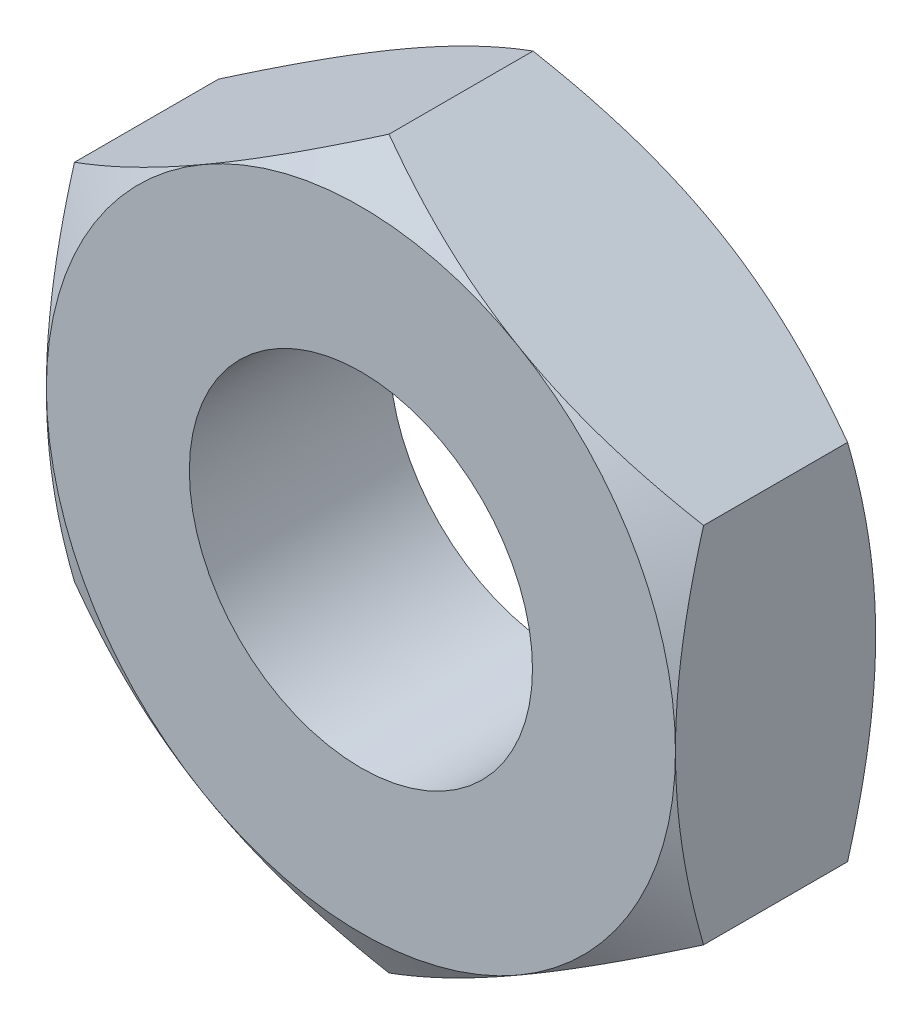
ISO-10303-21;
HEADER;
FILE_DESCRIPTION(('STEP AP214'),'2;1');
FILE_NAME('part.step','',(''),(''),'','','');
FILE_SCHEMA(('AUTOMOTIVE_DESIGN { 1 0 10303 214 1 1 1 1 }'));
ENDSEC;
DATA;
#1=APPLICATION_CONTEXT('core data for automotive mechanical design processes');
#2=APPLICATION_PROTOCOL_DEFINITION('international standard','automotive_design',2000,#1);
#3=PRODUCT_CONTEXT('',#1,'mechanical');
#4=PRODUCT('Part','Part','',(#3));
#5=PRODUCT_RELATED_PRODUCT_CATEGORY('part','',(#4));
#6=PRODUCT_DEFINITION_FORMATION('','',#4);
#7=PRODUCT_DEFINITION_CONTEXT('part definition',#1,'design');
#8=PRODUCT_DEFINITION('design','',#6,#7);
#9=PRODUCT_DEFINITION_SHAPE('','',#8);
#10=(LENGTH_UNIT() NAMED_UNIT(*) SI_UNIT(.MILLI.,.METRE.));
#11=(NAMED_UNIT(*) PLANE_ANGLE_UNIT() SI_UNIT($,.RADIAN.));
#12=(NAMED_UNIT(*) SI_UNIT($,.STERADIAN.) SOLID_ANGLE_UNIT());
#13=UNCERTAINTY_MEASURE_WITH_UNIT(LENGTH_MEASURE(1.E-05),#10,'distance_accuracy_value','');
#14=(GEOMETRIC_REPRESENTATION_CONTEXT(3) GLOBAL_UNCERTAINTY_ASSIGNED_CONTEXT((#13)) GLOBAL_UNIT_ASSIGNED_CONTEXT((#10,
#11,#12)) REPRESENTATION_CONTEXT('',''));
#15=CARTESIAN_POINT('',(0.,0.,0.));
#16=DIRECTION('',(0.,0.,1.));
#17=DIRECTION('',(1.,0.,0.));
#18=AXIS2_PLACEMENT_3D('',#15,#16,#17);
#19=CARTESIAN_POINT('',(11.,6.35085296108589,7.));
#20=DIRECTION('',(-0.5,-0.866025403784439,0.));
#21=DIRECTION('',(0.866025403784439,-0.5,0.));
#22=AXIS2_PLACEMENT_3D('',#19,#20,#21);
#23=PLANE('',#22);
#24=CARTESIAN_POINT('',(-0.000200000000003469,12.7018213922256,0.982547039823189));
#25=CARTESIAN_POINT('',(0.241603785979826,12.5622159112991,0.901959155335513));
#26=CARTESIAN_POINT('',(0.484309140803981,12.4220899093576,0.825028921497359));
#27=CARTESIAN_POINT('',(0.971666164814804,12.1407142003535,0.679498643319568));
#28=CARTESIAN_POINT('',(1.21631844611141,11.999464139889,0.610901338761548));
#29=CARTESIAN_POINT('',(1.9542173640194,11.5734380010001,0.418936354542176));
#30=CARTESIAN_POINT('',(2.45037695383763,11.2869801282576,0.309747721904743));
#31=CARTESIAN_POINT('',(3.19285703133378,10.8583090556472,0.181714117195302));
#32=CARTESIAN_POINT('',(3.43695934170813,10.7173765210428,0.145242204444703));
#33=CARTESIAN_POINT('',(3.92629418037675,10.4348589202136,0.084081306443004));
#34=CARTESIAN_POINT('',(4.17152673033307,10.2932738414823,0.0593925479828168));
#35=CARTESIAN_POINT('',(4.66240068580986,10.0098676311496,0.0224303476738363));
#36=CARTESIAN_POINT('',(4.90804125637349,9.86804698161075,0.0101421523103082));
#37=CARTESIAN_POINT('',(5.39955001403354,9.58427426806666,-0.00175707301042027));
#38=CARTESIAN_POINT('',(5.64541819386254,9.44232220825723,-0.00136849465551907));
#39=CARTESIAN_POINT('',(6.10507018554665,9.17694200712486,0.0112011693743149));
#40=CARTESIAN_POINT('',(6.31888677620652,9.05349494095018,0.0218490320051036));
#41=CARTESIAN_POINT('',(6.74602818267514,8.80688473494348,0.0525316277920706));
#42=CARTESIAN_POINT('',(6.95935296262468,8.68372161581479,0.0725670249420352));
#43=CARTESIAN_POINT('',(7.3853948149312,8.43774623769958,0.121675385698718));
#44=CARTESIAN_POINT('',(7.5981112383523,8.31493435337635,0.150755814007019));
#45=CARTESIAN_POINT('',(8.02254681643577,8.06988635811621,0.217443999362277));
#46=CARTESIAN_POINT('',(8.23426590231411,7.94765028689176,0.255052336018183));
#47=CARTESIAN_POINT('',(8.87695113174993,7.5765957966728,0.381619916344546));
#48=CARTESIAN_POINT('',(9.30605612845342,7.32885191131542,0.483199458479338));
#49=CARTESIAN_POINT('',(10.1578675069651,6.83705838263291,0.713743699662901));
#50=CARTESIAN_POINT('',(10.580584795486,6.59300244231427,0.842654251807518));
#51=CARTESIAN_POINT('',(11.0002,6.35073749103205,0.982547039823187));
#52=B_SPLINE_CURVE_WITH_KNOTS('',3,(#24,#25,#26,#27,#28,#29,#30,#31,#32,#33,#34,#35,#36,#37,#38,
#39,#40,#41,#42,#43,#44,#45,#46,#47,#48,#49,#50,#51),.UNSPECIFIED.,.F.,.F.,(4,2,2,2,2,2,2,2,2,2,
2,2,2,4),(0.,0.871755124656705,1.74379610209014,3.49159027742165,4.34403665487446,
5.19649943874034,6.04794680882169,6.89936787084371,7.64056020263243,8.38180496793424,
9.1236630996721,9.86557166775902,11.3820155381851,12.8954827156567),.UNSPECIFIED.);
#53=CARTESIAN_POINT('',(0.,12.7017059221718,0.982480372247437));
#54=VERTEX_POINT('',#53);
#55=CARTESIAN_POINT('',(5.5,9.52627944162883,0.));
#56=VERTEX_POINT('',#55);
#57=EDGE_CURVE('E29',#54,#56,#52,.T.);
#58=ORIENTED_EDGE('',*,*,#57,.F.);
#59=DIRECTION('',(0.,0.,-1.));
#60=VECTOR('',#59,1.);
#61=CARTESIAN_POINT('',(0.,12.7017059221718,7.));
#62=LINE('',#61,#60);
#63=CARTESIAN_POINT('',(0.,12.7017059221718,6.01751962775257));
#64=VERTEX_POINT('',#63);
#65=EDGE_CURVE('E146',#64,#54,#62,.T.);
#66=ORIENTED_EDGE('',*,*,#65,.F.);
#67=CARTESIAN_POINT('',(11.0002,6.35073749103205,6.01745296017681));
#68=CARTESIAN_POINT('',(10.7583962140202,6.49034297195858,6.09804084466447));
#69=CARTESIAN_POINT('',(10.515690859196,6.63046897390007,6.17497107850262));
#70=CARTESIAN_POINT('',(10.0283338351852,6.91184468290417,6.32050135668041));
#71=CARTESIAN_POINT('',(9.78368155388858,7.05309474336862,6.38909866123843));
#72=CARTESIAN_POINT('',(9.0457826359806,7.47912088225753,6.5810636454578));
#73=CARTESIAN_POINT('',(8.54962304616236,7.76557875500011,6.69025227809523));
#74=CARTESIAN_POINT('',(7.80714296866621,8.19424982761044,6.81828588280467));
#75=CARTESIAN_POINT('',(7.56304065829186,8.33518236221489,6.85475779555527));
#76=CARTESIAN_POINT('',(7.07370581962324,8.61769996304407,6.91591869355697));
#77=CARTESIAN_POINT('',(6.82847326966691,8.75928504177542,6.94060745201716));
#78=CARTESIAN_POINT('',(6.33759931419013,9.04269125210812,6.97756965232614));
#79=CARTESIAN_POINT('',(6.0919587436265,9.18451190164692,6.98985784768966));
#80=CARTESIAN_POINT('',(5.60044998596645,9.46828461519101,7.0017570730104));
#81=CARTESIAN_POINT('',(5.35458180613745,9.61023667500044,7.00136849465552));
#82=CARTESIAN_POINT('',(4.89492981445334,9.87561687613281,6.98879883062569));
#83=CARTESIAN_POINT('',(4.68111322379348,9.99906394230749,6.97815096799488));
#84=CARTESIAN_POINT('',(4.25397181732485,10.2456741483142,6.9474683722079));
#85=CARTESIAN_POINT('',(4.04064703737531,10.3688372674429,6.92743297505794));
#86=CARTESIAN_POINT('',(3.6146051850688,10.6148126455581,6.87832461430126));
#87=CARTESIAN_POINT('',(3.4018887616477,10.7376245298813,6.84924418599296));
#88=CARTESIAN_POINT('',(2.97745318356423,10.9826725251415,6.7825560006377));
#89=CARTESIAN_POINT('',(2.76573409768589,11.1049085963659,6.74494766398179));
#90=CARTESIAN_POINT('',(2.12304886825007,11.4759630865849,6.61838008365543));
#91=CARTESIAN_POINT('',(1.69394387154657,11.7237069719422,6.51680054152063));
#92=CARTESIAN_POINT('',(0.84213249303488,12.2155005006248,6.28625630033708));
#93=CARTESIAN_POINT('',(0.419415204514,12.4595564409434,6.15734574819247));
#94=CARTESIAN_POINT('',(-0.000200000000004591,12.7018213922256,6.01745296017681));
#95=B_SPLINE_CURVE_WITH_KNOTS('',3,(#67,#68,#69,#70,#71,#72,#73,#74,#75,#76,#77,#78,#79,#80,#81,
#82,#83,#84,#85,#86,#87,#88,#89,#90,#91,#92,#93,#94),.UNSPECIFIED.,.F.,.F.,(4,2,2,2,2,2,2,2,2,2,
2,2,2,4),(0.,0.871755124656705,1.74379610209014,3.49159027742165,4.34403665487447,
5.19649943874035,6.0479468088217,6.89936787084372,7.64056020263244,8.38180496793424,
9.1236630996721,9.86557166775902,11.3820155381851,12.8954827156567),.UNSPECIFIED.);
#96=CARTESIAN_POINT('',(5.5,9.52627944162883,7.));
#97=VERTEX_POINT('',#96);
#98=EDGE_CURVE('E205',#97,#64,#95,.T.);
#99=ORIENTED_EDGE('',*,*,#98,.F.);
#100=CARTESIAN_POINT('',(11.,6.35085296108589,6.01751962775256));
#101=VERTEX_POINT('',#100);
#102=EDGE_CURVE('E313',#101,#97,#95,.T.);
#103=ORIENTED_EDGE('',*,*,#102,.F.);
#104=DIRECTION('',(0.,0.,-1.));
#105=VECTOR('',#104,1.);
#106=CARTESIAN_POINT('',(11.,6.35085296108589,7.));
#107=LINE('',#106,#105);
#108=CARTESIAN_POINT('',(11.,6.35085296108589,0.982480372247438));
#109=VERTEX_POINT('',#108);
#110=EDGE_CURVE('E132',#101,#109,#107,.T.);
#111=ORIENTED_EDGE('',*,*,#110,.T.);
#112=EDGE_CURVE('E125',#56,#109,#52,.T.);
#113=ORIENTED_EDGE('',*,*,#112,.F.);
#114=EDGE_LOOP('',(#58,#66,#99,#103,#111,#113));
#115=FACE_BOUND('',#114,.T.);
#116=ADVANCED_FACE('F14',(#115),#23,.F.);
#117=CARTESIAN_POINT('',(0.,12.7017059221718,7.));
#118=DIRECTION('',(0.5,-0.866025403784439,0.));
#119=DIRECTION('',(0.866025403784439,0.5,0.));
#120=AXIS2_PLACEMENT_3D('',#117,#118,#119);
#121=PLANE('',#120);
#122=CARTESIAN_POINT('',(-11.0002,6.35073749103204,0.982547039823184));
#123=CARTESIAN_POINT('',(-10.7583962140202,6.49034297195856,0.901959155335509));
#124=CARTESIAN_POINT('',(-10.515690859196,6.63046897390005,0.825028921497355));
#125=CARTESIAN_POINT('',(-10.0283338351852,6.91184468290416,0.679498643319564));
#126=CARTESIAN_POINT('',(-9.78368155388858,7.05309474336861,0.610901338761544));
#127=CARTESIAN_POINT('',(-9.0457826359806,7.47912088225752,0.41893635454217));
#128=CARTESIAN_POINT('',(-8.54962304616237,7.76557875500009,0.309747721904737));
#129=CARTESIAN_POINT('',(-7.80714296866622,8.19424982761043,0.181714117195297));
#130=CARTESIAN_POINT('',(-7.56304065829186,8.33518236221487,0.145242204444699));
#131=CARTESIAN_POINT('',(-7.07370581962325,8.61769996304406,0.0840813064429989));
#132=CARTESIAN_POINT('',(-6.82847326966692,8.7592850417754,0.0593925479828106));
#133=CARTESIAN_POINT('',(-6.33759931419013,9.0426912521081,0.0224303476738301));
#134=CARTESIAN_POINT('',(-6.0919587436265,9.1845119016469,0.0101421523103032));
#135=CARTESIAN_POINT('',(-5.60044998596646,9.46828461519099,-0.00175707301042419));
#136=CARTESIAN_POINT('',(-5.35458180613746,9.61023667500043,-0.0013684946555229));
#137=CARTESIAN_POINT('',(-4.89492981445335,9.87561687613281,0.0112011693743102));
#138=CARTESIAN_POINT('',(-4.68111322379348,9.99906394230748,0.021849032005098));
#139=CARTESIAN_POINT('',(-4.25397181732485,10.2456741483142,0.0525316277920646));
#140=CARTESIAN_POINT('',(-4.04064703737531,10.3688372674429,0.0725670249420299));
#141=CARTESIAN_POINT('',(-3.6146051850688,10.6148126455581,0.121675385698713));
#142=CARTESIAN_POINT('',(-3.4018887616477,10.7376245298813,0.150755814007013));
#143=CARTESIAN_POINT('',(-2.97745318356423,10.9826725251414,0.217443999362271));
#144=CARTESIAN_POINT('',(-2.76573409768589,11.1049085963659,0.255052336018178));
#145=CARTESIAN_POINT('',(-2.12304886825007,11.4759630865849,0.381619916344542));
#146=CARTESIAN_POINT('',(-1.69394387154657,11.7237069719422,0.483199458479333));
#147=CARTESIAN_POINT('',(-0.84213249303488,12.2155005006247,0.713743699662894));
#148=CARTESIAN_POINT('',(-0.419415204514,12.4595564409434,0.842654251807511));
#149=CARTESIAN_POINT('',(0.000199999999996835,12.7018213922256,0.982547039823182));
#150=B_SPLINE_CURVE_WITH_KNOTS('',3,(#122,#123,#124,#125,#126,#127,#128,#129,#130,#131,#132,
#133,#134,#135,#136,#137,#138,#139,#140,#141,#142,#143,#144,#145,#146,#147,#148,#149),
.UNSPECIFIED.,.F.,.F.,(4,2,2,2,2,2,2,2,2,2,2,2,2,4),(0.,0.871755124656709,1.74379610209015,
3.49159027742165,4.34403665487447,5.19649943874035,6.04794680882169,6.89936787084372,
7.64056020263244,8.38180496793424,9.1236630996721,9.86557166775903,11.3820155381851,
12.8954827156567),.UNSPECIFIED.);
#151=CARTESIAN_POINT('',(-11.,6.35085296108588,0.982480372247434));
#152=VERTEX_POINT('',#151);
#153=CARTESIAN_POINT('',(-5.5,9.52627944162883,0.));
#154=VERTEX_POINT('',#153);
#155=EDGE_CURVE('E37',#152,#154,#150,.T.);
#156=ORIENTED_EDGE('',*,*,#155,.F.);
#157=DIRECTION('',(0.,0.,-1.));
#158=VECTOR('',#157,1.);
#159=CARTESIAN_POINT('',(-11.,6.35085296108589,7.));
#160=LINE('',#159,#158);
#161=CARTESIAN_POINT('',(-11.,6.35085296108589,6.01751962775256));
#162=VERTEX_POINT('',#161);
#163=EDGE_CURVE('E143',#162,#152,#160,.T.);
#164=ORIENTED_EDGE('',*,*,#163,.F.);
#165=CARTESIAN_POINT('',(0.000199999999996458,12.7018213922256,6.01745296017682));
#166=CARTESIAN_POINT('',(-0.241603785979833,12.5622159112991,6.09804084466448));
#167=CARTESIAN_POINT('',(-0.484309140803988,12.4220899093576,6.17497107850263));
#168=CARTESIAN_POINT('',(-0.971666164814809,12.1407142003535,6.32050135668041));
#169=CARTESIAN_POINT('',(-1.21631844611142,11.999464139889,6.38909866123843));
#170=CARTESIAN_POINT('',(-1.9542173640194,11.5734380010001,6.58106364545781));
#171=CARTESIAN_POINT('',(-2.45037695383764,11.2869801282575,6.69025227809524));
#172=CARTESIAN_POINT('',(-3.19285703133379,10.8583090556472,6.81828588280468));
#173=CARTESIAN_POINT('',(-3.43695934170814,10.7173765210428,6.85475779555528));
#174=CARTESIAN_POINT('',(-3.92629418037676,10.4348589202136,6.91591869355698));
#175=CARTESIAN_POINT('',(-4.17152673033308,10.2932738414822,6.94060745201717));
#176=CARTESIAN_POINT('',(-4.66240068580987,10.0098676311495,6.97756965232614));
#177=CARTESIAN_POINT('',(-4.9080412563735,9.86804698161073,6.98985784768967));
#178=CARTESIAN_POINT('',(-5.39955001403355,9.58427426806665,7.00175707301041));
#179=CARTESIAN_POINT('',(-5.64541819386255,9.44232220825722,7.00136849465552));
#180=CARTESIAN_POINT('',(-6.10507018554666,9.17694200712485,6.98879883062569));
#181=CARTESIAN_POINT('',(-6.31888677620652,9.05349494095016,6.97815096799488));
#182=CARTESIAN_POINT('',(-6.74602818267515,8.80688473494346,6.9474683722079));
#183=CARTESIAN_POINT('',(-6.95935296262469,8.68372161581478,6.92743297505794));
#184=CARTESIAN_POINT('',(-7.3853948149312,8.43774623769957,6.87832461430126));
#185=CARTESIAN_POINT('',(-7.5981112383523,8.31493435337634,6.84924418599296));
#186=CARTESIAN_POINT('',(-8.02254681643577,8.06988635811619,6.7825560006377));
#187=CARTESIAN_POINT('',(-8.23426590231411,7.94765028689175,6.7449476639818));
#188=CARTESIAN_POINT('',(-8.87695113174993,7.57659579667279,6.61838008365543));
#189=CARTESIAN_POINT('',(-9.30605612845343,7.32885191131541,6.51680054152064));
#190=CARTESIAN_POINT('',(-10.1578675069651,6.8370583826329,6.28625630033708));
#191=CARTESIAN_POINT('',(-10.580584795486,6.59300244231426,6.15734574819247));
#192=CARTESIAN_POINT('',(-11.0002,6.35073749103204,6.01745296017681));
#193=B_SPLINE_CURVE_WITH_KNOTS('',3,(#165,#166,#167,#168,#169,#170,#171,#172,#173,#174,#175,
#176,#177,#178,#179,#180,#181,#182,#183,#184,#185,#186,#187,#188,#189,#190,#191,#192),
.UNSPECIFIED.,.F.,.F.,(4,2,2,2,2,2,2,2,2,2,2,2,2,4),(0.,0.871755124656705,1.74379610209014,
3.49159027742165,4.34403665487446,5.19649943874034,6.04794680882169,6.89936787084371,
7.64056020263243,8.38180496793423,9.12366309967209,9.86557166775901,11.3820155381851,
12.8954827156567),.UNSPECIFIED.);
#194=CARTESIAN_POINT('',(-5.5,9.52627944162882,7.));
#195=VERTEX_POINT('',#194);
#196=EDGE_CURVE('E198',#195,#162,#193,.T.);
#197=ORIENTED_EDGE('',*,*,#196,.F.);
#198=EDGE_CURVE('E203',#64,#195,#193,.T.);
#199=ORIENTED_EDGE('',*,*,#198,.F.);
#200=ORIENTED_EDGE('',*,*,#65,.T.);
#201=EDGE_CURVE('E219',#154,#54,#150,.T.);
#202=ORIENTED_EDGE('',*,*,#201,.F.);
#203=EDGE_LOOP('',(#156,#164,#197,#199,#200,#202));
#204=FACE_BOUND('',#203,.T.);
#205=ADVANCED_FACE('F211',(#204),#121,.F.);
#206=CARTESIAN_POINT('',(-11.,6.35085296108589,7.));
#207=DIRECTION('',(1.,0.,0.));
#208=DIRECTION('',(0.,1.,0.));
#209=AXIS2_PLACEMENT_3D('',#206,#207,#208);
#210=PLANE('',#209);
#211=CARTESIAN_POINT('',(-11.,-16.9840885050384,5.3318873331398));
#212=CARTESIAN_POINT('',(-11.,-16.7441917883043,5.2156376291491));
#213=CARTESIAN_POINT('',(-11.,-16.5040115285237,5.09997333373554));
#214=CARTESIAN_POINT('',(-11.,-16.0230247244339,4.86994829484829));
#215=CARTESIAN_POINT('',(-11.,-15.7822181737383,4.75558756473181));
#216=CARTESIAN_POINT('',(-11.,-15.0587051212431,4.41462919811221));
#217=CARTESIAN_POINT('',(-11.,-14.5749773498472,4.19019043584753));
#218=CARTESIAN_POINT('',(-11.,-13.6015907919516,3.74721690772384));
#219=CARTESIAN_POINT('',(-11.,-13.1119140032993,3.52872160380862));
#220=CARTESIAN_POINT('',(-11.,-12.128639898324,3.10076972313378));
#221=CARTESIAN_POINT('',(-11.,-11.6350427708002,2.89131271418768));
#222=CARTESIAN_POINT('',(-11.,-10.6274881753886,2.47740062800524));
#223=CARTESIAN_POINT('',(-11.,-10.1133795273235,2.27331162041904));
#224=CARTESIAN_POINT('',(-11.,-9.07911609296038,1.88076176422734));
#225=CARTESIAN_POINT('',(-11.,-8.55896063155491,1.69230268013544));
#226=CARTESIAN_POINT('',(-11.,-7.5127914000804,1.33601802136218));
#227=CARTESIAN_POINT('',(-11.,-6.98679219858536,1.1681500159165));
#228=CARTESIAN_POINT('',(-11.,-5.92719900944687,0.858474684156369));
#229=CARTESIAN_POINT('',(-11.,-5.39360749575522,0.716659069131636));
#230=CARTESIAN_POINT('',(-11.,-4.58891434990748,0.529030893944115));
#231=CARTESIAN_POINT('',(-11.,-4.32069161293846,0.470793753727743));
#232=CARTESIAN_POINT('',(-11.,-3.78242763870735,0.363385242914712));
#233=CARTESIAN_POINT('',(-11.,-3.51238643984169,0.314213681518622));
#234=CARTESIAN_POINT('',(-11.,-2.97067673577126,0.225808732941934));
#235=CARTESIAN_POINT('',(-11.,-2.69900824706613,0.186575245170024));
#236=CARTESIAN_POINT('',(-11.,-2.15433855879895,0.118831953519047));
#237=CARTESIAN_POINT('',(-11.,-1.88133741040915,0.0903217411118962));
#238=CARTESIAN_POINT('',(-11.,-1.33791470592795,0.0449446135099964));
#239=CARTESIAN_POINT('',(-11.,-1.06750538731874,0.0279320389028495));
#240=CARTESIAN_POINT('',(-11.,-0.526210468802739,0.00535229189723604));
#241=CARTESIAN_POINT('',(-11.,-0.255324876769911,-0.000215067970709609));
#242=CARTESIAN_POINT('',(-11.,0.286439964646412,0.000227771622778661));
#243=CARTESIAN_POINT('',(-11.,0.557319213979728,0.00623804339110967));
#244=CARTESIAN_POINT('',(-11.,1.09858564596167,0.0296908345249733));
#245=CARTESIAN_POINT('',(-11.,1.36897280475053,0.0471338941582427));
#246=CARTESIAN_POINT('',(-11.,2.02110256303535,0.102623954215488));
#247=CARTESIAN_POINT('',(-11.,2.40238084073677,0.146223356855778));
#248=CARTESIAN_POINT('',(-11.,3.16206007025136,0.253762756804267));
#249=CARTESIAN_POINT('',(-11.,3.54046061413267,0.317705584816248));
#250=CARTESIAN_POINT('',(-11.,4.29404048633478,0.463656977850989));
#251=CARTESIAN_POINT('',(-11.,4.66921700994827,0.545679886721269));
#252=CARTESIAN_POINT('',(-11.,5.4157832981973,0.725292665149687));
#253=CARTESIAN_POINT('',(-11.,5.78717312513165,0.822882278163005));
#254=CARTESIAN_POINT('',(-11.,6.53425919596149,1.03354404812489));
#255=CARTESIAN_POINT('',(-11.,6.90987275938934,1.14690740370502));
#256=CARTESIAN_POINT('',(-11.,7.65739903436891,1.38518033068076));
#257=CARTESIAN_POINT('',(-11.,8.02931172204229,1.5100899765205));
#258=CARTESIAN_POINT('',(-11.,8.76962268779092,1.76948687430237));
#259=CARTESIAN_POINT('',(-11.,9.1380221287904,1.90397082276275));
#260=CARTESIAN_POINT('',(-11.,9.87177985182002,2.18095058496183));
#261=CARTESIAN_POINT('',(-11.,10.2371381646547,2.32344631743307));
#262=CARTESIAN_POINT('',(-11.,11.0790169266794,2.66073366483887));
#263=CARTESIAN_POINT('',(-11.,11.5545670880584,2.85794306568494));
#264=CARTESIAN_POINT('',(-11.,12.5017815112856,3.26150850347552));
#265=CARTESIAN_POINT('',(-11.,12.9734455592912,3.46786503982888));
#266=CARTESIAN_POINT('',(-11.,13.9135842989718,3.88794944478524));
#267=CARTESIAN_POINT('',(-11.,14.3820583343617,4.10167877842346));
#268=CARTESIAN_POINT('',(-11.,15.3162376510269,4.53506873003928));
#269=CARTESIAN_POINT('',(-11.,15.7819429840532,4.75472923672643));
#270=CARTESIAN_POINT('',(-11.,16.7114982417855,5.19912871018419));
#271=CARTESIAN_POINT('',(-11.,17.1753458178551,5.42387258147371));
#272=CARTESIAN_POINT('',(-11.,18.1010724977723,5.8773774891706));
#273=CARTESIAN_POINT('',(-11.,18.5629515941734,6.1061385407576));
#274=CARTESIAN_POINT('',(-11.,19.4849820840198,6.56698070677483));
#275=CARTESIAN_POINT('',(-11.,19.945133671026,6.79906143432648));
#276=CARTESIAN_POINT('',(-11.,20.864006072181,7.26603974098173));
#277=CARTESIAN_POINT('',(-11.,21.3227268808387,7.50093733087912));
#278=CARTESIAN_POINT('',(-11.,22.6235178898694,8.17129985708));
#279=CARTESIAN_POINT('',(-11.,23.4641281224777,8.60959780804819));
#280=CARTESIAN_POINT('',(-11.,25.1421953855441,9.49223873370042));
#281=CARTESIAN_POINT('',(-11.,25.9796523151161,9.93658189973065));
#282=CARTESIAN_POINT('',(-11.,27.6501346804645,10.828880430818));
#283=CARTESIAN_POINT('',(-11.,28.4831658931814,11.2768249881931));
#284=CARTESIAN_POINT('',(-11.,29.731214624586,11.9514590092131));
#285=CARTESIAN_POINT('',(-11.,30.1469707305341,12.1767841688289));
#286=CARTESIAN_POINT('',(-11.,30.9780387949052,12.628250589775));
#287=CARTESIAN_POINT('',(-11.,31.3933507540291,12.8543918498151));
#288=CARTESIAN_POINT('',(-11.,31.8084653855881,13.0808948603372));
#289=B_SPLINE_CURVE_WITH_KNOTS('',3,(#211,#212,#213,#214,#215,#216,#217,#218,#219,#220,#221,
#222,#223,#224,#225,#226,#227,#228,#229,#230,#231,#232,#233,#234,#235,#236,#237,#238,#239,#240,
#241,#242,#243,#244,#245,#246,#247,#248,#249,#250,#251,#252,#253,#254,#255,#256,#257,#258,#259,
#260,#261,#262,#263,#264,#265,#266,#267,#268,#269,#270,#271,#272,#273,#274,#275,#276,#277,#278,
#279,#280,#281,#282,#283,#284,#285,#286,#287,#288),.UNSPECIFIED.,.F.,.F.,(4,2,2,2,2,2,2,2,2,2,2,
2,2,2,2,2,2,2,2,2,2,2,2,2,2,2,2,2,2,2,2,2,2,2,2,2,2,2,4),(0.,0.799735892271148,1.59947997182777,
3.19920870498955,4.80777426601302,6.41626282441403,8.07547841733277,9.73488107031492,
11.3908047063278,13.0462005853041,13.8694888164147,14.6927597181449,15.5160222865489,
16.3392534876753,17.1518495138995,17.9644322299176,18.7770200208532,19.5896462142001,
20.7402967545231,21.8911074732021,23.0428344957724,24.1945425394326,25.3713637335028,
26.5481925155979,27.7246171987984,28.9010299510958,30.4453619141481,31.9897782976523,
33.5345033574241,35.0791994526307,36.6254554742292,38.1717173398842,39.7178004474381,
41.2638894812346,44.1078946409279,46.9519900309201,49.7894692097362,51.2081373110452,
52.6268031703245),.UNSPECIFIED.);
#290=CARTESIAN_POINT('',(-11.,-6.35085296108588,0.982480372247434));
#291=VERTEX_POINT('',#290);
#292=CARTESIAN_POINT('',(-11.,0.,0.));
#293=VERTEX_POINT('',#292);
#294=EDGE_CURVE('E237',#291,#293,#289,.T.);
#295=ORIENTED_EDGE('',*,*,#294,.F.);
#296=DIRECTION('',(0.,0.,-1.));
#297=VECTOR('',#296,1.);
#298=CARTESIAN_POINT('',(-11.,-6.35085296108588,7.));
#299=LINE('',#298,#297);
#300=CARTESIAN_POINT('',(-11.,-6.35085296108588,6.01751962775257));
#301=VERTEX_POINT('',#300);
#302=EDGE_CURVE('E134',#301,#291,#299,.T.);
#303=ORIENTED_EDGE('',*,*,#302,.F.);
#304=CARTESIAN_POINT('',(-11.,-16.9840885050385,1.6681126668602));
#305=CARTESIAN_POINT('',(-11.,-16.7441917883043,1.78436237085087));
#306=CARTESIAN_POINT('',(-11.,-16.5040115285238,1.90002666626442));
#307=CARTESIAN_POINT('',(-11.,-16.023024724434,2.13005170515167));
#308=CARTESIAN_POINT('',(-11.,-15.7822181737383,2.24441243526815));
#309=CARTESIAN_POINT('',(-11.,-15.0587051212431,2.58537080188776));
#310=CARTESIAN_POINT('',(-11.,-14.5749773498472,2.80980956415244));
#311=CARTESIAN_POINT('',(-11.,-13.6015907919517,3.25278309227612));
#312=CARTESIAN_POINT('',(-11.,-13.1119140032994,3.47127839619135));
#313=CARTESIAN_POINT('',(-11.,-12.1286398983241,3.89923027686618));
#314=CARTESIAN_POINT('',(-11.,-11.6350427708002,4.10868728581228));
#315=CARTESIAN_POINT('',(-11.,-10.6274881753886,4.52259937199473));
#316=CARTESIAN_POINT('',(-11.,-10.1133795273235,4.72668837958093));
#317=CARTESIAN_POINT('',(-11.,-9.07911609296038,5.11923823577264));
#318=CARTESIAN_POINT('',(-11.,-8.55896063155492,5.30769731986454));
#319=CARTESIAN_POINT('',(-11.,-7.5127914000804,5.66398197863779));
#320=CARTESIAN_POINT('',(-11.,-6.98679219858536,5.83184998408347));
#321=CARTESIAN_POINT('',(-11.,-5.92719900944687,6.14152531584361));
#322=CARTESIAN_POINT('',(-11.,-5.39360749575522,6.28334093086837));
#323=CARTESIAN_POINT('',(-11.,-4.58891434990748,6.47096910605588));
#324=CARTESIAN_POINT('',(-11.,-4.32069161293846,6.52920624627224));
#325=CARTESIAN_POINT('',(-11.,-3.78242763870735,6.63661475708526));
#326=CARTESIAN_POINT('',(-11.,-3.51238643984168,6.68578631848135));
#327=CARTESIAN_POINT('',(-11.,-2.97067673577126,6.77419126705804));
#328=CARTESIAN_POINT('',(-11.,-2.69900824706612,6.81342475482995));
#329=CARTESIAN_POINT('',(-11.,-2.15433855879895,6.88116804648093));
#330=CARTESIAN_POINT('',(-11.,-1.88133741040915,6.90967825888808));
#331=CARTESIAN_POINT('',(-11.,-1.33791470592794,6.95505538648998));
#332=CARTESIAN_POINT('',(-11.,-1.06750538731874,6.97206796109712));
#333=CARTESIAN_POINT('',(-11.,-0.526210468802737,6.99464770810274));
#334=CARTESIAN_POINT('',(-11.,-0.25532487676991,7.00021506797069));
#335=CARTESIAN_POINT('',(-11.,0.286439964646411,6.9997722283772));
#336=CARTESIAN_POINT('',(-11.,0.557319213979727,6.99376195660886));
#337=CARTESIAN_POINT('',(-11.,1.09858564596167,6.97030916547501));
#338=CARTESIAN_POINT('',(-11.,1.36897280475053,6.95286610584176));
#339=CARTESIAN_POINT('',(-11.,2.02110256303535,6.89737604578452));
#340=CARTESIAN_POINT('',(-11.,2.40238084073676,6.85377664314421));
#341=CARTESIAN_POINT('',(-11.,3.16206007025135,6.7462372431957));
#342=CARTESIAN_POINT('',(-11.,3.54046061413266,6.68229441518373));
#343=CARTESIAN_POINT('',(-11.,4.29404048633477,6.53634302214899));
#344=CARTESIAN_POINT('',(-11.,4.66921700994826,6.45432011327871));
#345=CARTESIAN_POINT('',(-11.,5.41578329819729,6.27470733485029));
#346=CARTESIAN_POINT('',(-11.,5.78717312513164,6.17711772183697));
#347=CARTESIAN_POINT('',(-11.,6.53425919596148,5.96645595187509));
#348=CARTESIAN_POINT('',(-11.,6.90987275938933,5.85309259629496));
#349=CARTESIAN_POINT('',(-11.,7.6573990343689,5.61481966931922));
#350=CARTESIAN_POINT('',(-11.,8.02931172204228,5.48991002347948));
#351=CARTESIAN_POINT('',(-11.,8.76962268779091,5.2305131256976));
#352=CARTESIAN_POINT('',(-11.,9.13802212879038,5.09602917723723));
#353=CARTESIAN_POINT('',(-11.,9.87177985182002,4.81904941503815));
#354=CARTESIAN_POINT('',(-11.,10.2371381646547,4.67655368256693));
#355=CARTESIAN_POINT('',(-11.,11.0790169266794,4.33926633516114));
#356=CARTESIAN_POINT('',(-11.,11.5545670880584,4.14205693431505));
#357=CARTESIAN_POINT('',(-11.,12.5017815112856,3.73849149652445));
#358=CARTESIAN_POINT('',(-11.,12.9734455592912,3.53213496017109));
#359=CARTESIAN_POINT('',(-11.,13.9135842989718,3.11205055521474));
#360=CARTESIAN_POINT('',(-11.,14.3820583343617,2.89832122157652));
#361=CARTESIAN_POINT('',(-11.,15.3162376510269,2.4649312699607));
#362=CARTESIAN_POINT('',(-11.,15.7819429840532,2.24527076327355));
#363=CARTESIAN_POINT('',(-11.,16.7114982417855,1.80087128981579));
#364=CARTESIAN_POINT('',(-11.,17.1753458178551,1.57612741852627));
#365=CARTESIAN_POINT('',(-11.,18.1010724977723,1.12262251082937));
#366=CARTESIAN_POINT('',(-11.,18.5629515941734,0.893861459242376));
#367=CARTESIAN_POINT('',(-11.,19.4849820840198,0.433019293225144));
#368=CARTESIAN_POINT('',(-11.,19.945133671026,0.200938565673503));
#369=CARTESIAN_POINT('',(-11.,20.864006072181,-0.26603974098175));
#370=CARTESIAN_POINT('',(-11.,21.3227268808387,-0.500937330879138));
#371=CARTESIAN_POINT('',(-11.,22.6235178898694,-1.17129985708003));
#372=CARTESIAN_POINT('',(-11.,23.4641281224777,-1.60959780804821));
#373=CARTESIAN_POINT('',(-11.,25.1421953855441,-2.49223873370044));
#374=CARTESIAN_POINT('',(-11.,25.9796523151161,-2.93658189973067));
#375=CARTESIAN_POINT('',(-11.,27.6501346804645,-3.82888043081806));
#376=CARTESIAN_POINT('',(-11.,28.4831658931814,-4.27682498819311));
#377=CARTESIAN_POINT('',(-11.,29.731214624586,-4.95145900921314));
#378=CARTESIAN_POINT('',(-11.,30.1469707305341,-5.1767841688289));
#379=CARTESIAN_POINT('',(-11.,30.9780387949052,-5.62825058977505));
#380=CARTESIAN_POINT('',(-11.,31.3933507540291,-5.85439184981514));
#381=CARTESIAN_POINT('',(-11.,31.8084653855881,-6.08089486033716));
#382=B_SPLINE_CURVE_WITH_KNOTS('',3,(#304,#305,#306,#307,#308,#309,#310,#311,#312,#313,#314,
#315,#316,#317,#318,#319,#320,#321,#322,#323,#324,#325,#326,#327,#328,#329,#330,#331,#332,#333,
#334,#335,#336,#337,#338,#339,#340,#341,#342,#343,#344,#345,#346,#347,#348,#349,#350,#351,#352,
#353,#354,#355,#356,#357,#358,#359,#360,#361,#362,#363,#364,#365,#366,#367,#368,#369,#370,#371,
#372,#373,#374,#375,#376,#377,#378,#379,#380,#381),.UNSPECIFIED.,.F.,.F.,(4,2,2,2,2,2,2,2,2,2,2,
2,2,2,2,2,2,2,2,2,2,2,2,2,2,2,2,2,2,2,2,2,2,2,2,2,2,2,4),(0.,0.799735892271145,1.59947997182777,
3.19920870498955,4.80777426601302,6.41626282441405,8.0754784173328,9.73488107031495,
11.3908047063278,13.0462005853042,13.8694888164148,14.692759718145,15.5160222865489,
16.3392534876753,17.1518495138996,17.9644322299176,18.7770200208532,19.5896462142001,
20.7402967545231,21.8911074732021,23.0428344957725,24.1945425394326,25.3713637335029,
26.5481925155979,27.7246171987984,28.9010299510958,30.4453619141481,31.9897782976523,
33.5345033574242,35.0791994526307,36.6254554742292,38.1717173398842,39.7178004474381,
41.2638894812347,44.1078946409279,46.9519900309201,49.7894692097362,51.2081373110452,
52.6268031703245),.UNSPECIFIED.);
#383=CARTESIAN_POINT('',(-11.,0.,7.));
#384=VERTEX_POINT('',#383);
#385=EDGE_CURVE('E191',#384,#301,#382,.F.);
#386=ORIENTED_EDGE('',*,*,#385,.F.);
#387=EDGE_CURVE('E204',#162,#384,#382,.F.);
#388=ORIENTED_EDGE('',*,*,#387,.F.);
#389=ORIENTED_EDGE('',*,*,#163,.T.);
#390=EDGE_CURVE('E232',#293,#152,#289,.T.);
#391=ORIENTED_EDGE('',*,*,#390,.F.);
#392=EDGE_LOOP('',(#295,#303,#386,#388,#389,#391));
#393=FACE_BOUND('',#392,.T.);
#394=ADVANCED_FACE('F214',(#393),#210,.F.);
#395=CARTESIAN_POINT('',(-11.,-6.35085296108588,7.));
#396=DIRECTION('',(0.5,0.866025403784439,0.));
#397=DIRECTION('',(-0.866025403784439,0.5,0.));
#398=AXIS2_PLACEMENT_3D('',#395,#396,#397);
#399=PLANE('',#398);
#400=CARTESIAN_POINT('',(0.000199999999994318,-12.7018213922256,0.98254703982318));
#401=CARTESIAN_POINT('',(-0.241603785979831,-12.5622159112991,0.901959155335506));
#402=CARTESIAN_POINT('',(-0.484309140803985,-12.4220899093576,0.825028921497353));
#403=CARTESIAN_POINT('',(-0.971666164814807,-12.1407142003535,0.679498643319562));
#404=CARTESIAN_POINT('',(-1.21631844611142,-11.999464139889,0.610901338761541));
#405=CARTESIAN_POINT('',(-1.9542173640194,-11.5734380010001,0.418936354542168));
#406=CARTESIAN_POINT('',(-2.45037695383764,-11.2869801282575,0.309747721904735));
#407=CARTESIAN_POINT('',(-3.19285703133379,-10.8583090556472,0.181714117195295));
#408=CARTESIAN_POINT('',(-3.43695934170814,-10.7173765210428,0.145242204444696));
#409=CARTESIAN_POINT('',(-3.92629418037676,-10.4348589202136,0.0840813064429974));
#410=CARTESIAN_POINT('',(-4.17152673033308,-10.2932738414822,0.0593925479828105));
#411=CARTESIAN_POINT('',(-4.66240068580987,-10.0098676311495,0.0224303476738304));
#412=CARTESIAN_POINT('',(-4.9080412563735,-9.86804698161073,0.0101421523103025));
#413=CARTESIAN_POINT('',(-5.39955001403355,-9.58427426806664,-0.00175707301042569));
#414=CARTESIAN_POINT('',(-5.64541819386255,-9.44232220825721,-0.00136849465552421));
#415=CARTESIAN_POINT('',(-6.10507018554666,-9.17694200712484,0.01120116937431));
#416=CARTESIAN_POINT('',(-6.31888677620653,-9.05349494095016,0.0218490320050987));
#417=CARTESIAN_POINT('',(-6.74602818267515,-8.80688473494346,0.0525316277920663));
#418=CARTESIAN_POINT('',(-6.95935296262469,-8.68372161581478,0.0725670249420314));
#419=CARTESIAN_POINT('',(-7.3853948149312,-8.43774623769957,0.121675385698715));
#420=CARTESIAN_POINT('',(-7.5981112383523,-8.31493435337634,0.150755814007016));
#421=CARTESIAN_POINT('',(-8.02254681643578,-8.06988635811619,0.217443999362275));
#422=CARTESIAN_POINT('',(-8.23426590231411,-7.94765028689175,0.255052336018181));
#423=CARTESIAN_POINT('',(-8.87695113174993,-7.57659579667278,0.381619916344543));
#424=CARTESIAN_POINT('',(-9.30605612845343,-7.32885191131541,0.483199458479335));
#425=CARTESIAN_POINT('',(-10.1578675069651,-6.8370583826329,0.713743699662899));
#426=CARTESIAN_POINT('',(-10.580584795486,-6.59300244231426,0.842654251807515));
#427=CARTESIAN_POINT('',(-11.0002,-6.35073749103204,0.982547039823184));
#428=B_SPLINE_CURVE_WITH_KNOTS('',3,(#400,#401,#402,#403,#404,#405,#406,#407,#408,#409,#410,
#411,#412,#413,#414,#415,#416,#417,#418,#419,#420,#421,#422,#423,#424,#425,#426,#427),
.UNSPECIFIED.,.F.,.F.,(4,2,2,2,2,2,2,2,2,2,2,2,2,4),(0.,0.871755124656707,1.74379610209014,
3.49159027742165,4.34403665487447,5.19649943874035,6.0479468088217,6.89936787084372,
7.64056020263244,8.38180496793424,9.1236630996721,9.86557166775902,11.3820155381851,
12.8954827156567),.UNSPECIFIED.);
#429=CARTESIAN_POINT('',(0.,-12.7017059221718,0.982480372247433));
#430=VERTEX_POINT('',#429);
#431=CARTESIAN_POINT('',(-5.5,-9.52627944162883,0.));
#432=VERTEX_POINT('',#431);
#433=EDGE_CURVE('E226',#430,#432,#428,.T.);
#434=ORIENTED_EDGE('',*,*,#433,.F.);
#435=DIRECTION('',(0.,0.,-1.));
#436=VECTOR('',#435,1.);
#437=CARTESIAN_POINT('',(0.,-12.7017059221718,7.));
#438=LINE('',#437,#436);
#439=CARTESIAN_POINT('',(0.,-12.7017059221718,6.01751962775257));
#440=VERTEX_POINT('',#439);
#441=EDGE_CURVE('E131',#440,#430,#438,.T.);
#442=ORIENTED_EDGE('',*,*,#441,.F.);
#443=CARTESIAN_POINT('',(-11.0002,-6.35073749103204,6.01745296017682));
#444=CARTESIAN_POINT('',(-10.7583962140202,-6.49034297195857,6.09804084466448));
#445=CARTESIAN_POINT('',(-10.515690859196,-6.63046897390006,6.17497107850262));
#446=CARTESIAN_POINT('',(-10.0283338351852,-6.91184468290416,6.32050135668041));
#447=CARTESIAN_POINT('',(-9.78368155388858,-7.05309474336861,6.38909866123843));
#448=CARTESIAN_POINT('',(-9.0457826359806,-7.47912088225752,6.58106364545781));
#449=CARTESIAN_POINT('',(-8.54962304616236,-7.7655787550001,6.69025227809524));
#450=CARTESIAN_POINT('',(-7.80714296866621,-8.19424982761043,6.81828588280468));
#451=CARTESIAN_POINT('',(-7.56304065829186,-8.33518236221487,6.85475779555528));
#452=CARTESIAN_POINT('',(-7.07370581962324,-8.61769996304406,6.91591869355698));
#453=CARTESIAN_POINT('',(-6.82847326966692,-8.7592850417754,6.94060745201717));
#454=CARTESIAN_POINT('',(-6.33759931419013,-9.0426912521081,6.97756965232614));
#455=CARTESIAN_POINT('',(-6.0919587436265,-9.1845119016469,6.98985784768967));
#456=CARTESIAN_POINT('',(-5.60044998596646,-9.46828461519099,7.00175707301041));
#457=CARTESIAN_POINT('',(-5.35458180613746,-9.61023667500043,7.00136849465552));
#458=CARTESIAN_POINT('',(-4.89492981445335,-9.87561687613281,6.98879883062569));
#459=CARTESIAN_POINT('',(-4.68111322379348,-9.99906394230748,6.97815096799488));
#460=CARTESIAN_POINT('',(-4.25397181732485,-10.2456741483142,6.94746837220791));
#461=CARTESIAN_POINT('',(-4.04064703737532,-10.3688372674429,6.92743297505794));
#462=CARTESIAN_POINT('',(-3.61460518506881,-10.6148126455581,6.87832461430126));
#463=CARTESIAN_POINT('',(-3.40188876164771,-10.7376245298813,6.84924418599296));
#464=CARTESIAN_POINT('',(-2.97745318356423,-10.9826725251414,6.7825560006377));
#465=CARTESIAN_POINT('',(-2.7657340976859,-11.1049085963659,6.7449476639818));
#466=CARTESIAN_POINT('',(-2.12304886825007,-11.4759630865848,6.61838008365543));
#467=CARTESIAN_POINT('',(-1.69394387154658,-11.7237069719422,6.51680054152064));
#468=CARTESIAN_POINT('',(-0.842132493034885,-12.2155005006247,6.28625630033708));
#469=CARTESIAN_POINT('',(-0.419415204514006,-12.4595564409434,6.15734574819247));
#470=CARTESIAN_POINT('',(0.000199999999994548,-12.7018213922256,6.01745296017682));
#471=B_SPLINE_CURVE_WITH_KNOTS('',3,(#443,#444,#445,#446,#447,#448,#449,#450,#451,#452,#453,
#454,#455,#456,#457,#458,#459,#460,#461,#462,#463,#464,#465,#466,#467,#468,#469,#470),
.UNSPECIFIED.,.F.,.F.,(4,2,2,2,2,2,2,2,2,2,2,2,2,4),(0.,0.871755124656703,1.74379610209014,
3.49159027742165,4.34403665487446,5.19649943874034,6.04794680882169,6.89936787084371,
7.64056020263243,8.38180496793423,9.12366309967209,9.86557166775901,11.3820155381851,
12.8954827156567),.UNSPECIFIED.);
#472=CARTESIAN_POINT('',(-5.5,-9.52627944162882,7.));
#473=VERTEX_POINT('',#472);
#474=EDGE_CURVE('E184',#473,#440,#471,.T.);
#475=ORIENTED_EDGE('',*,*,#474,.F.);
#476=EDGE_CURVE('E484',#301,#473,#471,.T.);
#477=ORIENTED_EDGE('',*,*,#476,.F.);
#478=ORIENTED_EDGE('',*,*,#302,.T.);
#479=EDGE_CURVE('E238',#432,#291,#428,.T.);
#480=ORIENTED_EDGE('',*,*,#479,.F.);
#481=EDGE_LOOP('',(#434,#442,#475,#477,#478,#480));
#482=FACE_BOUND('',#481,.T.);
#483=ADVANCED_FACE('F292',(#482),#399,.F.);
#484=CARTESIAN_POINT('',(0.,-12.7017059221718,7.));
#485=DIRECTION('',(-0.5,0.866025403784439,0.));
#486=DIRECTION('',(-0.866025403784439,-0.5,0.));
#487=AXIS2_PLACEMENT_3D('',#484,#485,#486);
#488=PLANE('',#487);
#489=CARTESIAN_POINT('',(11.0002,-6.35073749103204,0.982547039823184));
#490=CARTESIAN_POINT('',(10.7583962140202,-6.49034297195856,0.901959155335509));
#491=CARTESIAN_POINT('',(10.515690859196,-6.63046897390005,0.825028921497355));
#492=CARTESIAN_POINT('',(10.0283338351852,-6.91184468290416,0.679498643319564));
#493=CARTESIAN_POINT('',(9.78368155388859,-7.05309474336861,0.610901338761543));
#494=CARTESIAN_POINT('',(9.04578263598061,-7.47912088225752,0.41893635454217));
#495=CARTESIAN_POINT('',(8.54962304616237,-7.76557875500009,0.309747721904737));
#496=CARTESIAN_POINT('',(7.80714296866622,-8.19424982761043,0.181714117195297));
#497=CARTESIAN_POINT('',(7.56304065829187,-8.33518236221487,0.145242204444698));
#498=CARTESIAN_POINT('',(7.07370581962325,-8.61769996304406,0.0840813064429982));
#499=CARTESIAN_POINT('',(6.82847326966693,-8.7592850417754,0.0593925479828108));
#500=CARTESIAN_POINT('',(6.33759931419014,-9.0426912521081,0.02243034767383));
#501=CARTESIAN_POINT('',(6.09195874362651,-9.1845119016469,0.0101421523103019));
#502=CARTESIAN_POINT('',(5.60044998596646,-9.46828461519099,-0.0017570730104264));
#503=CARTESIAN_POINT('',(5.35458180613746,-9.61023667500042,-0.00136849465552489));
#504=CARTESIAN_POINT('',(4.89492981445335,-9.8756168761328,0.0112011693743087));
#505=CARTESIAN_POINT('',(4.68111322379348,-9.99906394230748,0.0218490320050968));
#506=CARTESIAN_POINT('',(4.25397181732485,-10.2456741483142,0.0525316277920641));
#507=CARTESIAN_POINT('',(4.04064703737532,-10.3688372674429,0.0725670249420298));
#508=CARTESIAN_POINT('',(3.6146051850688,-10.6148126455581,0.121675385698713));
#509=CARTESIAN_POINT('',(3.4018887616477,-10.7376245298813,0.150755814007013));
#510=CARTESIAN_POINT('',(2.97745318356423,-10.9826725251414,0.217443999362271));
#511=CARTESIAN_POINT('',(2.76573409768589,-11.1049085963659,0.255052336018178));
#512=CARTESIAN_POINT('',(2.12304886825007,-11.4759630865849,0.381619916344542));
#513=CARTESIAN_POINT('',(1.69394387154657,-11.7237069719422,0.483199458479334));
#514=CARTESIAN_POINT('',(0.842132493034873,-12.2155005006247,0.713743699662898));
#515=CARTESIAN_POINT('',(0.419415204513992,-12.4595564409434,0.842654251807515));
#516=CARTESIAN_POINT('',(-0.000200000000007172,-12.7018213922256,0.982547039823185));
#517=B_SPLINE_CURVE_WITH_KNOTS('',3,(#489,#490,#491,#492,#493,#494,#495,#496,#497,#498,#499,
#500,#501,#502,#503,#504,#505,#506,#507,#508,#509,#510,#511,#512,#513,#514,#515,#516),
.UNSPECIFIED.,.F.,.F.,(4,2,2,2,2,2,2,2,2,2,2,2,2,4),(0.,0.871755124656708,1.74379610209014,
3.49159027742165,4.34403665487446,5.19649943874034,6.04794680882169,6.89936787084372,
7.64056020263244,8.38180496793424,9.1236630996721,9.86557166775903,11.3820155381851,
12.8954827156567),.UNSPECIFIED.);
#518=CARTESIAN_POINT('',(11.,-6.35085296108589,0.982480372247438));
#519=VERTEX_POINT('',#518);
#520=CARTESIAN_POINT('',(5.5,-9.52627944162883,0.));
#521=VERTEX_POINT('',#520);
#522=EDGE_CURVE('E108',#519,#521,#517,.T.);
#523=ORIENTED_EDGE('',*,*,#522,.F.);
#524=DIRECTION('',(0.,0.,-1.));
#525=VECTOR('',#524,1.);
#526=CARTESIAN_POINT('',(11.,-6.35085296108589,7.));
#527=LINE('',#526,#525);
#528=CARTESIAN_POINT('',(11.,-6.35085296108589,6.01751962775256));
#529=VERTEX_POINT('',#528);
#530=EDGE_CURVE('E122',#529,#519,#527,.T.);
#531=ORIENTED_EDGE('',*,*,#530,.F.);
#532=CARTESIAN_POINT('',(-0.000200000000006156,-12.7018213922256,6.01745296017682));
#533=CARTESIAN_POINT('',(0.241603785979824,-12.5622159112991,6.09804084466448));
#534=CARTESIAN_POINT('',(0.484309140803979,-12.4220899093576,6.17497107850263));
#535=CARTESIAN_POINT('',(0.971666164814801,-12.1407142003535,6.32050135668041));
#536=CARTESIAN_POINT('',(1.21631844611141,-11.999464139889,6.38909866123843));
#537=CARTESIAN_POINT('',(1.95421736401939,-11.5734380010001,6.58106364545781));
#538=CARTESIAN_POINT('',(2.45037695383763,-11.2869801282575,6.69025227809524));
#539=CARTESIAN_POINT('',(3.19285703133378,-10.8583090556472,6.81828588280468));
#540=CARTESIAN_POINT('',(3.43695934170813,-10.7173765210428,6.85475779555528));
#541=CARTESIAN_POINT('',(3.92629418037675,-10.4348589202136,6.91591869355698));
#542=CARTESIAN_POINT('',(4.17152673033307,-10.2932738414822,6.94060745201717));
#543=CARTESIAN_POINT('',(4.66240068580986,-10.0098676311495,6.97756965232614));
#544=CARTESIAN_POINT('',(4.90804125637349,-9.86804698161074,6.98985784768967));
#545=CARTESIAN_POINT('',(5.39955001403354,-9.58427426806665,7.00175707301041));
#546=CARTESIAN_POINT('',(5.64541819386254,-9.44232220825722,7.00136849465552));
#547=CARTESIAN_POINT('',(6.10507018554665,-9.17694200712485,6.98879883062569));
#548=CARTESIAN_POINT('',(6.31888677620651,-9.05349494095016,6.97815096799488));
#549=CARTESIAN_POINT('',(6.74602818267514,-8.80688473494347,6.94746837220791));
#550=CARTESIAN_POINT('',(6.95935296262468,-8.68372161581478,6.92743297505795));
#551=CARTESIAN_POINT('',(7.38539481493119,-8.43774623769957,6.87832461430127));
#552=CARTESIAN_POINT('',(7.59811123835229,-8.31493435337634,6.84924418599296));
#553=CARTESIAN_POINT('',(8.02254681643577,-8.06988635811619,6.7825560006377));
#554=CARTESIAN_POINT('',(8.2342659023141,-7.94765028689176,6.7449476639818));
#555=CARTESIAN_POINT('',(8.87695113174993,-7.57659579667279,6.61838008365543));
#556=CARTESIAN_POINT('',(9.30605612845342,-7.32885191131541,6.51680054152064));
#557=CARTESIAN_POINT('',(10.1578675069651,-6.8370583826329,6.28625630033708));
#558=CARTESIAN_POINT('',(10.580584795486,-6.59300244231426,6.15734574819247));
#559=CARTESIAN_POINT('',(11.0002,-6.35073749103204,6.01745296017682));
#560=B_SPLINE_CURVE_WITH_KNOTS('',3,(#532,#533,#534,#535,#536,#537,#538,#539,#540,#541,#542,
#543,#544,#545,#546,#547,#548,#549,#550,#551,#552,#553,#554,#555,#556,#557,#558,#559),
.UNSPECIFIED.,.F.,.F.,(4,2,2,2,2,2,2,2,2,2,2,2,2,4),(0.,0.871755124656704,1.74379610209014,
3.49159027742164,4.34403665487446,5.19649943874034,6.04794680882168,6.89936787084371,
7.64056020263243,8.38180496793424,9.12366309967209,9.86557166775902,11.3820155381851,
12.8954827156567),.UNSPECIFIED.);
#561=CARTESIAN_POINT('',(5.5,-9.52627944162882,7.));
#562=VERTEX_POINT('',#561);
#563=EDGE_CURVE('E176',#562,#529,#560,.T.);
#564=ORIENTED_EDGE('',*,*,#563,.F.);
#565=EDGE_CURVE('E247',#440,#562,#560,.T.);
#566=ORIENTED_EDGE('',*,*,#565,.F.);
#567=ORIENTED_EDGE('',*,*,#441,.T.);
#568=EDGE_CURVE('E124',#521,#430,#517,.T.);
#569=ORIENTED_EDGE('',*,*,#568,.F.);
#570=EDGE_LOOP('',(#523,#531,#564,#566,#567,#569));
#571=FACE_BOUND('',#570,.T.);
#572=ADVANCED_FACE('F120',(#571),#488,.F.);
#573=CARTESIAN_POINT('',(11.,-6.35085296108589,7.));
#574=DIRECTION('',(-1.,0.,0.));
#575=DIRECTION('',(0.,0.,1.));
#576=AXIS2_PLACEMENT_3D('',#573,#574,#575);
#577=PLANE('',#576);
#578=CARTESIAN_POINT('',(11.,-16.9840885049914,5.33188733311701));
#579=CARTESIAN_POINT('',(11.,-16.744191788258,5.21563762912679));
#580=CARTESIAN_POINT('',(11.,-16.5040115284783,5.09997333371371));
#581=CARTESIAN_POINT('',(11.,-16.0230247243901,4.86994829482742));
#582=CARTESIAN_POINT('',(11.,-15.7822181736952,4.75558756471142));
#583=CARTESIAN_POINT('',(11.,-15.0587051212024,4.41462919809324));
#584=CARTESIAN_POINT('',(11.,-14.5749773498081,4.19019043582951));
#585=CARTESIAN_POINT('',(11.,-13.6015907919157,3.74721690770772));
#586=CARTESIAN_POINT('',(11.,-13.111914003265,3.52872160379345));
#587=CARTESIAN_POINT('',(11.,-12.128639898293,3.1007697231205));
#588=CARTESIAN_POINT('',(11.,-11.6350427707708,2.89131271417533));
#589=CARTESIAN_POINT('',(11.,-10.6274881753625,2.47740062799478));
#590=CARTESIAN_POINT('',(11.,-10.1133795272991,2.27331162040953));
#591=CARTESIAN_POINT('',(11.,-9.07911609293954,1.88076176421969));
#592=CARTESIAN_POINT('',(11.,-8.55896063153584,1.69230268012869));
#593=CARTESIAN_POINT('',(11.,-7.5127914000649,1.33601802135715));
#594=CARTESIAN_POINT('',(11.,-6.98679219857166,1.16815001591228));
#595=CARTESIAN_POINT('',(11.,-5.92719900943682,0.858474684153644));
#596=CARTESIAN_POINT('',(11.,-5.39360749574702,0.716659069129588));
#597=CARTESIAN_POINT('',(11.,-4.58891434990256,0.529030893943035));
#598=CARTESIAN_POINT('',(11.,-4.32069161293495,0.470793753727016));
#599=CARTESIAN_POINT('',(11.,-3.78242763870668,0.3633852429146));
#600=CARTESIAN_POINT('',(11.,-3.51238643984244,0.314213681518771));
#601=CARTESIAN_POINT('',(11.,-2.97067673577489,0.225808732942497));
#602=CARTESIAN_POINT('',(11.,-2.69900824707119,0.18657524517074));
#603=CARTESIAN_POINT('',(11.,-2.15433855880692,0.11883195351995));
#604=CARTESIAN_POINT('',(11.,-1.88133741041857,0.0903217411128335));
#605=CARTESIAN_POINT('',(11.,-1.33791470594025,0.0449446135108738));
#606=CARTESIAN_POINT('',(11.,-1.06750538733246,0.027932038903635));
#607=CARTESIAN_POINT('',(11.,-0.526210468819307,0.00535229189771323));
#608=CARTESIAN_POINT('',(11.,-0.255324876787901,-0.000215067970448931));
#609=CARTESIAN_POINT('',(11.,0.286439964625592,0.000227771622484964));
#610=CARTESIAN_POINT('',(11.,0.557319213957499,0.00623804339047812));
#611=CARTESIAN_POINT('',(11.,1.09858564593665,0.029690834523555));
#612=CARTESIAN_POINT('',(11.,1.36897280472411,0.0471338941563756));
#613=CARTESIAN_POINT('',(11.,2.02110256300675,0.102623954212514));
#614=CARTESIAN_POINT('',(11.,2.40238084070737,0.146223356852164));
#615=CARTESIAN_POINT('',(11.,3.16206007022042,0.253762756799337));
#616=CARTESIAN_POINT('',(11.,3.54046061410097,0.317705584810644));
#617=CARTESIAN_POINT('',(11.,4.2940404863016,0.463656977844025));
#618=CARTESIAN_POINT('',(11.,4.66921700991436,0.545679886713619));
#619=CARTESIAN_POINT('',(11.,5.41578329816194,0.72529266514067));
#620=CARTESIAN_POINT('',(11.,5.78717312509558,0.822882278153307));
#621=CARTESIAN_POINT('',(11.,6.53425919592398,1.03354404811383));
#622=CARTESIAN_POINT('',(11.,6.9098727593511,1.14690740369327));
#623=CARTESIAN_POINT('',(11.,7.65739903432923,1.38518033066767));
#624=CARTESIAN_POINT('',(11.,8.02931172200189,1.51008997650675));
#625=CARTESIAN_POINT('',(11.,8.76962268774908,1.76948687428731));
#626=CARTESIAN_POINT('',(11.,9.13802212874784,1.90397082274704));
#627=CARTESIAN_POINT('',(11.,9.87177985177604,2.18095058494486));
#628=CARTESIAN_POINT('',(11.,10.23713816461,2.32344631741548));
#629=CARTESIAN_POINT('',(11.,11.0790169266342,2.66073366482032));
#630=CARTESIAN_POINT('',(11.,11.5545670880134,2.8579430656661));
#631=CARTESIAN_POINT('',(11.,12.501781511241,3.26150850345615));
#632=CARTESIAN_POINT('',(11.,12.9734455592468,3.46786503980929));
#633=CARTESIAN_POINT('',(11.,13.9135842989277,3.88794944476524));
#634=CARTESIAN_POINT('',(11.,14.3820583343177,4.10167877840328));
#635=CARTESIAN_POINT('',(11.,15.3162376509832,4.53506873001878));
#636=CARTESIAN_POINT('',(11.,15.7819429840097,4.75472923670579));
#637=CARTESIAN_POINT('',(11.,16.7114982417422,5.19912871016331));
#638=CARTESIAN_POINT('',(11.,17.175345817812,5.42387258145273));
#639=CARTESIAN_POINT('',(11.,18.1010724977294,5.87737748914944));
#640=CARTESIAN_POINT('',(11.,18.5629515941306,6.10613854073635));
#641=CARTESIAN_POINT('',(11.,19.4849820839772,6.56698070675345));
#642=CARTESIAN_POINT('',(11.,19.9451336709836,6.79906143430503));
#643=CARTESIAN_POINT('',(11.,20.8640060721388,7.26603974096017));
#644=CARTESIAN_POINT('',(11.,21.3227268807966,7.50093733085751));
#645=CARTESIAN_POINT('',(11.,22.6235178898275,8.17129985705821));
#646=CARTESIAN_POINT('',(11.,23.4641281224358,8.60959780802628));
#647=CARTESIAN_POINT('',(11.,25.1421953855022,9.49223873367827));
#648=CARTESIAN_POINT('',(11.,25.9796523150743,9.93658189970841));
#649=CARTESIAN_POINT('',(11.,27.6501346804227,10.8288804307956));
#650=CARTESIAN_POINT('',(11.,28.4831658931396,11.2768249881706));
#651=CARTESIAN_POINT('',(11.,29.7312146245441,11.9514590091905));
#652=CARTESIAN_POINT('',(11.,30.1469707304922,12.1767841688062));
#653=CARTESIAN_POINT('',(11.,30.9780387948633,12.6282505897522));
#654=CARTESIAN_POINT('',(11.,31.3933507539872,12.8543918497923));
#655=CARTESIAN_POINT('',(11.,31.8084653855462,13.0808948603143));
#656=B_SPLINE_CURVE_WITH_KNOTS('',3,(#578,#579,#580,#581,#582,#583,#584,#585,#586,#587,#588,
#589,#590,#591,#592,#593,#594,#595,#596,#597,#598,#599,#600,#601,#602,#603,#604,#605,#606,#607,
#608,#609,#610,#611,#612,#613,#614,#615,#616,#617,#618,#619,#620,#621,#622,#623,#624,#625,#626,
#627,#628,#629,#630,#631,#632,#633,#634,#635,#636,#637,#638,#639,#640,#641,#642,#643,#644,#645,
#646,#647,#648,#649,#650,#651,#652,#653,#654,#655),.UNSPECIFIED.,.F.,.F.,(4,2,2,2,2,2,2,2,2,2,2,
2,2,2,2,2,2,2,2,2,2,2,2,2,2,2,2,2,2,2,2,2,2,2,2,2,2,2,4),(0.,0.799735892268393,1.59947997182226,
3.19920870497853,4.80777426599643,6.41626282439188,8.07547841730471,9.73488107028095,
11.3908047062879,13.0462005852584,13.8694888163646,14.6927597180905,15.5160222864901,
16.3392534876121,17.1518495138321,17.964432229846,18.7770200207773,19.58964621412,
20.7402967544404,21.8911074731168,23.0428344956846,24.1945425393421,25.3713637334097,
26.5481925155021,27.7246171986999,28.9010299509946,30.4453619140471,31.9897782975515,
33.5345033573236,35.0791994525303,36.6254554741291,38.1717173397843,39.7178004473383,
41.2638894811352,44.1078946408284,46.9519900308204,49.7894692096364,51.2081373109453,
52.6268031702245),.UNSPECIFIED.);
#657=CARTESIAN_POINT('',(11.,0.,0.));
#658=VERTEX_POINT('',#657);
#659=EDGE_CURVE('E114',#109,#658,#656,.F.);
#660=ORIENTED_EDGE('',*,*,#659,.F.);
#661=ORIENTED_EDGE('',*,*,#110,.F.);
#662=CARTESIAN_POINT('',(11.,-16.9840885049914,1.66811266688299));
#663=CARTESIAN_POINT('',(11.,-16.744191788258,1.78436237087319));
#664=CARTESIAN_POINT('',(11.,-16.5040115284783,1.90002666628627));
#665=CARTESIAN_POINT('',(11.,-16.0230247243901,2.13005170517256));
#666=CARTESIAN_POINT('',(11.,-15.7822181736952,2.24441243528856));
#667=CARTESIAN_POINT('',(11.,-15.0587051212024,2.58537080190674));
#668=CARTESIAN_POINT('',(11.,-14.5749773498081,2.80980956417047));
#669=CARTESIAN_POINT('',(11.,-13.6015907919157,3.25278309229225));
#670=CARTESIAN_POINT('',(11.,-13.111914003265,3.47127839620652));
#671=CARTESIAN_POINT('',(11.,-12.128639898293,3.89923027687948));
#672=CARTESIAN_POINT('',(11.,-11.6350427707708,4.10868728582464));
#673=CARTESIAN_POINT('',(11.,-10.6274881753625,4.5225993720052));
#674=CARTESIAN_POINT('',(11.,-10.1133795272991,4.72668837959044));
#675=CARTESIAN_POINT('',(11.,-9.07911609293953,5.11923823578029));
#676=CARTESIAN_POINT('',(11.,-8.55896063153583,5.30769731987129));
#677=CARTESIAN_POINT('',(11.,-7.51279140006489,5.66398197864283));
#678=CARTESIAN_POINT('',(11.,-6.98679219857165,5.83184998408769));
#679=CARTESIAN_POINT('',(11.,-5.92719900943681,6.14152531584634));
#680=CARTESIAN_POINT('',(11.,-5.39360749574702,6.28334093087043));
#681=CARTESIAN_POINT('',(11.,-4.58891434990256,6.47096910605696));
#682=CARTESIAN_POINT('',(11.,-4.32069161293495,6.52920624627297));
#683=CARTESIAN_POINT('',(11.,-3.78242763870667,6.63661475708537));
#684=CARTESIAN_POINT('',(11.,-3.51238643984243,6.6857863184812));
#685=CARTESIAN_POINT('',(11.,-2.97067673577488,6.77419126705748));
#686=CARTESIAN_POINT('',(11.,-2.69900824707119,6.81342475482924));
#687=CARTESIAN_POINT('',(11.,-2.15433855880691,6.88116804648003));
#688=CARTESIAN_POINT('',(11.,-1.88133741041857,6.90967825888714));
#689=CARTESIAN_POINT('',(11.,-1.33791470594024,6.9550553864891));
#690=CARTESIAN_POINT('',(11.,-1.06750538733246,6.97206796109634));
#691=CARTESIAN_POINT('',(11.,-0.526210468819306,6.99464770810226));
#692=CARTESIAN_POINT('',(11.,-0.255324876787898,7.00021506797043));
#693=CARTESIAN_POINT('',(11.,0.286439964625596,6.99977222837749));
#694=CARTESIAN_POINT('',(11.,0.557319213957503,6.99376195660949));
#695=CARTESIAN_POINT('',(11.,1.09858564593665,6.97030916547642));
#696=CARTESIAN_POINT('',(11.,1.36897280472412,6.95286610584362));
#697=CARTESIAN_POINT('',(11.,2.02110256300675,6.89737604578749));
#698=CARTESIAN_POINT('',(11.,2.40238084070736,6.85377664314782));
#699=CARTESIAN_POINT('',(11.,3.16206007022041,6.74623724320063));
#700=CARTESIAN_POINT('',(11.,3.54046061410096,6.68229441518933));
#701=CARTESIAN_POINT('',(11.,4.29404048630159,6.53634302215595));
#702=CARTESIAN_POINT('',(11.,4.66921700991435,6.45432011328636));
#703=CARTESIAN_POINT('',(11.,5.41578329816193,6.27470733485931));
#704=CARTESIAN_POINT('',(11.,5.78717312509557,6.17711772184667));
#705=CARTESIAN_POINT('',(11.,6.53425919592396,5.96645595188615));
#706=CARTESIAN_POINT('',(11.,6.90987275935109,5.85309259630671));
#707=CARTESIAN_POINT('',(11.,7.65739903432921,5.61481966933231));
#708=CARTESIAN_POINT('',(11.,8.02931172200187,5.48991002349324));
#709=CARTESIAN_POINT('',(11.,8.76962268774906,5.23051312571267));
#710=CARTESIAN_POINT('',(11.,9.13802212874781,5.09602917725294));
#711=CARTESIAN_POINT('',(11.,9.87177985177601,4.81904941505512));
#712=CARTESIAN_POINT('',(11.,10.23713816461,4.67655368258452));
#713=CARTESIAN_POINT('',(11.,11.0790169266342,4.33926633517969));
#714=CARTESIAN_POINT('',(11.,11.5545670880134,4.14205693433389));
#715=CARTESIAN_POINT('',(11.,12.5017815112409,3.73849149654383));
#716=CARTESIAN_POINT('',(11.,12.9734455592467,3.5321349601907));
#717=CARTESIAN_POINT('',(11.,13.9135842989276,3.11205055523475));
#718=CARTESIAN_POINT('',(11.,14.3820583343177,2.89832122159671));
#719=CARTESIAN_POINT('',(11.,15.3162376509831,2.46493126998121));
#720=CARTESIAN_POINT('',(11.,15.7819429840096,2.2452707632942));
#721=CARTESIAN_POINT('',(11.,16.7114982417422,1.80087128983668));
#722=CARTESIAN_POINT('',(11.,17.1753458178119,1.57612741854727));
#723=CARTESIAN_POINT('',(11.,18.1010724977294,1.12262251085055));
#724=CARTESIAN_POINT('',(11.,18.5629515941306,0.893861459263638));
#725=CARTESIAN_POINT('',(11.,19.4849820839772,0.433019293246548));
#726=CARTESIAN_POINT('',(11.,19.9451336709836,0.200938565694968));
#727=CARTESIAN_POINT('',(11.,20.8640060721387,-0.266039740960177));
#728=CARTESIAN_POINT('',(11.,21.3227268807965,-0.500937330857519));
#729=CARTESIAN_POINT('',(11.,22.6235178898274,-1.17129985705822));
#730=CARTESIAN_POINT('',(11.,23.4641281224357,-1.60959780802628));
#731=CARTESIAN_POINT('',(11.,25.1421953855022,-2.49223873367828));
#732=CARTESIAN_POINT('',(11.,25.9796523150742,-2.93658189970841));
#733=CARTESIAN_POINT('',(11.,27.6501346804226,-3.8288804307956));
#734=CARTESIAN_POINT('',(11.,28.4831658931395,-4.27682498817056));
#735=CARTESIAN_POINT('',(11.,29.7312146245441,-4.95145900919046));
#736=CARTESIAN_POINT('',(11.,30.1469707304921,-5.17678416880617));
#737=CARTESIAN_POINT('',(11.,30.9780387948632,-5.62825058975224));
#738=CARTESIAN_POINT('',(11.,31.3933507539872,-5.85439184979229));
#739=CARTESIAN_POINT('',(11.,31.8084653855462,-6.08089486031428));
#740=B_SPLINE_CURVE_WITH_KNOTS('',3,(#662,#663,#664,#665,#666,#667,#668,#669,#670,#671,#672,
#673,#674,#675,#676,#677,#678,#679,#680,#681,#682,#683,#684,#685,#686,#687,#688,#689,#690,#691,
#692,#693,#694,#695,#696,#697,#698,#699,#700,#701,#702,#703,#704,#705,#706,#707,#708,#709,#710,
#711,#712,#713,#714,#715,#716,#717,#718,#719,#720,#721,#722,#723,#724,#725,#726,#727,#728,#729,
#730,#731,#732,#733,#734,#735,#736,#737,#738,#739),.UNSPECIFIED.,.F.,.F.,(4,2,2,2,2,2,2,2,2,2,2,
2,2,2,2,2,2,2,2,2,2,2,2,2,2,2,2,2,2,2,2,2,2,2,2,2,2,2,4),(0.,0.799735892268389,1.59947997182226,
3.19920870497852,4.80777426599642,6.41626282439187,8.0754784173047,9.73488107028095,
11.3908047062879,13.0462005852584,13.8694888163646,14.6927597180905,15.5160222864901,
16.3392534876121,17.1518495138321,17.964432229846,18.7770200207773,19.58964621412,
20.7402967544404,21.8911074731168,23.0428344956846,24.1945425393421,25.3713637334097,
26.548192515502,27.7246171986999,28.9010299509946,30.4453619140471,31.9897782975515,
33.5345033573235,35.0791994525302,36.625455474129,38.1717173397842,39.7178004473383,
41.2638894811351,44.1078946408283,46.9519900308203,49.7894692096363,51.2081373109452,
52.6268031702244),.UNSPECIFIED.);
#741=CARTESIAN_POINT('',(11.,0.,7.));
#742=VERTEX_POINT('',#741);
#743=EDGE_CURVE('E148',#742,#101,#740,.T.);
#744=ORIENTED_EDGE('',*,*,#743,.F.);
#745=EDGE_CURVE('E130',#529,#742,#740,.T.);
#746=ORIENTED_EDGE('',*,*,#745,.F.);
#747=ORIENTED_EDGE('',*,*,#530,.T.);
#748=EDGE_CURVE('E105',#658,#519,#656,.F.);
#749=ORIENTED_EDGE('',*,*,#748,.F.);
#750=EDGE_LOOP('',(#660,#661,#744,#746,#747,#749));
#751=FACE_BOUND('',#750,.T.);
#752=ADVANCED_FACE('F128',(#751),#577,.F.);
#753=CARTESIAN_POINT('',(-11.,19.0525588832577,0.));
#754=DIRECTION('',(0.,0.,1.));
#755=DIRECTION('',(1.,0.,0.));
#756=AXIS2_PLACEMENT_3D('',#753,#754,#755);
#757=PLANE('',#756);
#758=CARTESIAN_POINT('',(0.,0.,0.));
#759=DIRECTION('',(0.,0.,1.));
#760=DIRECTION('',(1.,0.,0.));
#761=AXIS2_PLACEMENT_3D('',#758,#759,#760);
#762=CIRCLE('',#761,6.);
#763=CARTESIAN_POINT('',(6.,0.,0.));
#764=VERTEX_POINT('',#763);
#765=EDGE_CURVE('E137',#764,#764,#762,.F.);
#766=ORIENTED_EDGE('',*,*,#765,.F.);
#767=EDGE_LOOP('',(#766));
#768=FACE_BOUND('',#767,.T.);
#769=CARTESIAN_POINT('',(0.,0.,0.));
#770=DIRECTION('',(0.,0.,1.));
#771=DIRECTION('',(1.,0.,0.));
#772=AXIS2_PLACEMENT_3D('',#769,#770,#771);
#773=CIRCLE('',#772,11.);
#774=EDGE_CURVE('E115',#658,#56,#773,.T.);
#775=ORIENTED_EDGE('',*,*,#774,.F.);
#776=CARTESIAN_POINT('',(0.,0.,0.));
#777=DIRECTION('',(0.,0.,1.));
#778=DIRECTION('',(1.,0.,0.));
#779=AXIS2_PLACEMENT_3D('',#776,#777,#778);
#780=CIRCLE('',#779,11.);
#781=EDGE_CURVE('E18',#521,#658,#780,.T.);
#782=ORIENTED_EDGE('',*,*,#781,.F.);
#783=EDGE_CURVE('E268',#432,#521,#780,.T.);
#784=ORIENTED_EDGE('',*,*,#783,.F.);
#785=EDGE_CURVE('E256',#293,#432,#780,.T.);
#786=ORIENTED_EDGE('',*,*,#785,.F.);
#787=EDGE_CURVE('E23',#154,#293,#780,.T.);
#788=ORIENTED_EDGE('',*,*,#787,.F.);
#789=EDGE_CURVE('E9',#56,#154,#780,.T.);
#790=ORIENTED_EDGE('',*,*,#789,.F.);
#791=EDGE_LOOP('',(#775,#782,#784,#786,#788,#790));
#792=FACE_BOUND('',#791,.T.);
#793=ADVANCED_FACE('F267',(#768,#792),#757,.F.);
#794=CARTESIAN_POINT('',(-11.,19.0525588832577,7.));
#795=DIRECTION('',(0.,0.,1.));
#796=DIRECTION('',(1.,0.,0.));
#797=AXIS2_PLACEMENT_3D('',#794,#795,#796);
#798=PLANE('',#797);
#799=CARTESIAN_POINT('',(0.,0.,7.));
#800=DIRECTION('',(0.,0.,1.));
#801=DIRECTION('',(1.,0.,0.));
#802=AXIS2_PLACEMENT_3D('',#799,#800,#801);
#803=CIRCLE('',#802,6.);
#804=CARTESIAN_POINT('',(6.,0.,7.));
#805=VERTEX_POINT('',#804);
#806=EDGE_CURVE('E315',#805,#805,#803,.T.);
#807=ORIENTED_EDGE('',*,*,#806,.F.);
#808=EDGE_LOOP('',(#807));
#809=FACE_BOUND('',#808,.T.);
#810=CARTESIAN_POINT('',(0.,0.,7.));
#811=DIRECTION('',(0.,0.,1.));
#812=DIRECTION('',(1.,0.,0.));
#813=AXIS2_PLACEMENT_3D('',#810,#811,#812);
#814=CIRCLE('',#813,11.);
#815=EDGE_CURVE('E242',#562,#742,#814,.T.);
#816=ORIENTED_EDGE('',*,*,#815,.T.);
#817=EDGE_CURVE('E239',#742,#97,#814,.T.);
#818=ORIENTED_EDGE('',*,*,#817,.T.);
#819=EDGE_CURVE('E241',#97,#195,#814,.T.);
#820=ORIENTED_EDGE('',*,*,#819,.T.);
#821=EDGE_CURVE('E248',#195,#384,#814,.T.);
#822=ORIENTED_EDGE('',*,*,#821,.T.);
#823=EDGE_CURVE('E251',#384,#473,#814,.T.);
#824=ORIENTED_EDGE('',*,*,#823,.T.);
#825=EDGE_CURVE('E249',#473,#562,#814,.T.);
#826=ORIENTED_EDGE('',*,*,#825,.T.);
#827=EDGE_LOOP('',(#816,#818,#820,#822,#824,#826));
#828=FACE_BOUND('',#827,.T.);
#829=ADVANCED_FACE('F325',(#809,#828),#798,.T.);
#830=CARTESIAN_POINT('',(0.,0.,-3.));
#831=DIRECTION('',(0.,0.,1.));
#832=DIRECTION('',(1.,0.,0.));
#833=AXIS2_PLACEMENT_3D('',#830,#831,#832);
#834=CYLINDRICAL_SURFACE('',#833,6.);
#835=ORIENTED_EDGE('',*,*,#806,.T.);
#836=EDGE_LOOP('',(#835));
#837=FACE_BOUND('',#836,.T.);
#838=ORIENTED_EDGE('',*,*,#765,.T.);
#839=EDGE_LOOP('',(#838));
#840=FACE_BOUND('',#839,.T.);
#841=ADVANCED_FACE('F164',(#837,#840),#834,.F.);
#842=CARTESIAN_POINT('',(0.,0.,7.));
#843=DIRECTION('',(0.,0.,-1.));
#844=DIRECTION('',(-1.,0.,0.));
#845=AXIS2_PLACEMENT_3D('',#842,#843,#844);
#846=CONICAL_SURFACE('',#845,11.,1.0471975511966);
#847=ORIENTED_EDGE('',*,*,#102,.T.);
#848=ORIENTED_EDGE('',*,*,#817,.F.);
#849=ORIENTED_EDGE('',*,*,#743,.T.);
#850=EDGE_LOOP('',(#847,#848,#849));
#851=FACE_BOUND('',#850,.T.);
#852=ADVANCED_FACE('F158',(#851),#846,.T.);
#853=ORIENTED_EDGE('',*,*,#563,.T.);
#854=ORIENTED_EDGE('',*,*,#745,.T.);
#855=ORIENTED_EDGE('',*,*,#815,.F.);
#856=EDGE_LOOP('',(#853,#854,#855));
#857=FACE_BOUND('',#856,.T.);
#858=ADVANCED_FACE('F163',(#857),#846,.T.);
#859=ORIENTED_EDGE('',*,*,#474,.T.);
#860=ORIENTED_EDGE('',*,*,#565,.T.);
#861=ORIENTED_EDGE('',*,*,#825,.F.);
#862=EDGE_LOOP('',(#859,#860,#861));
#863=FACE_BOUND('',#862,.T.);
#864=ADVANCED_FACE('F389',(#863),#846,.T.);
#865=ORIENTED_EDGE('',*,*,#385,.T.);
#866=ORIENTED_EDGE('',*,*,#476,.T.);
#867=ORIENTED_EDGE('',*,*,#823,.F.);
#868=EDGE_LOOP('',(#865,#866,#867));
#869=FACE_BOUND('',#868,.T.);
#870=ADVANCED_FACE('F397',(#869),#846,.T.);
#871=ORIENTED_EDGE('',*,*,#196,.T.);
#872=ORIENTED_EDGE('',*,*,#387,.T.);
#873=ORIENTED_EDGE('',*,*,#821,.F.);
#874=EDGE_LOOP('',(#871,#872,#873));
#875=FACE_BOUND('',#874,.T.);
#876=ADVANCED_FACE('F405',(#875),#846,.T.);
#877=ORIENTED_EDGE('',*,*,#98,.T.);
#878=ORIENTED_EDGE('',*,*,#198,.T.);
#879=ORIENTED_EDGE('',*,*,#819,.F.);
#880=EDGE_LOOP('',(#877,#878,#879));
#881=FACE_BOUND('',#880,.T.);
#882=ADVANCED_FACE('F166',(#881),#846,.T.);
#883=CARTESIAN_POINT('',(0.,0.,1.9938961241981));
#884=DIRECTION('',(0.,0.,1.));
#885=DIRECTION('',(1.,0.,0.));
#886=AXIS2_PLACEMENT_3D('',#883,#884,#885);
#887=CONICAL_SURFACE('',#886,14.4535293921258,1.0471975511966);
#888=ORIENTED_EDGE('',*,*,#522,.T.);
#889=ORIENTED_EDGE('',*,*,#781,.T.);
#890=ORIENTED_EDGE('',*,*,#748,.T.);
#891=EDGE_LOOP('',(#888,#889,#890));
#892=FACE_BOUND('',#891,.T.);
#893=ADVANCED_FACE('F107',(#892),#887,.T.);
#894=ORIENTED_EDGE('',*,*,#433,.T.);
#895=ORIENTED_EDGE('',*,*,#783,.T.);
#896=ORIENTED_EDGE('',*,*,#568,.T.);
#897=EDGE_LOOP('',(#894,#895,#896));
#898=FACE_BOUND('',#897,.T.);
#899=ADVANCED_FACE('F426',(#898),#887,.T.);
#900=ORIENTED_EDGE('',*,*,#294,.T.);
#901=ORIENTED_EDGE('',*,*,#785,.T.);
#902=ORIENTED_EDGE('',*,*,#479,.T.);
#903=EDGE_LOOP('',(#900,#901,#902));
#904=FACE_BOUND('',#903,.T.);
#905=ADVANCED_FACE('F167',(#904),#887,.T.);
#906=ORIENTED_EDGE('',*,*,#390,.T.);
#907=ORIENTED_EDGE('',*,*,#155,.T.);
#908=ORIENTED_EDGE('',*,*,#787,.T.);
#909=EDGE_LOOP('',(#906,#907,#908));
#910=FACE_BOUND('',#909,.T.);
#911=ADVANCED_FACE('F263',(#910),#887,.T.);
#912=ORIENTED_EDGE('',*,*,#201,.T.);
#913=ORIENTED_EDGE('',*,*,#57,.T.);
#914=ORIENTED_EDGE('',*,*,#789,.T.);
#915=EDGE_LOOP('',(#912,#913,#914));
#916=FACE_BOUND('',#915,.T.);
#917=ADVANCED_FACE('F434',(#916),#887,.T.);
#918=ORIENTED_EDGE('',*,*,#112,.T.);
#919=ORIENTED_EDGE('',*,*,#659,.T.);
#920=ORIENTED_EDGE('',*,*,#774,.T.);
#921=EDGE_LOOP('',(#918,#919,#920));
#922=FACE_BOUND('',#921,.T.);
#923=ADVANCED_FACE('F427',(#922),#887,.T.);
#924=CLOSED_SHELL('',(#116,#205,#394,#483,#572,#752,#793,#829,#841,#852,#858,#864,#870,#876,
#882,#893,#899,#905,#911,#917,#923));
#925=MANIFOLD_SOLID_BREP('B1',#924);
#926=ADVANCED_BREP_SHAPE_REPRESENTATION('',(#18,#925),#14);
#927=SHAPE_DEFINITION_REPRESENTATION(#9,#926);
ENDSEC;
END-ISO-10303-21;
